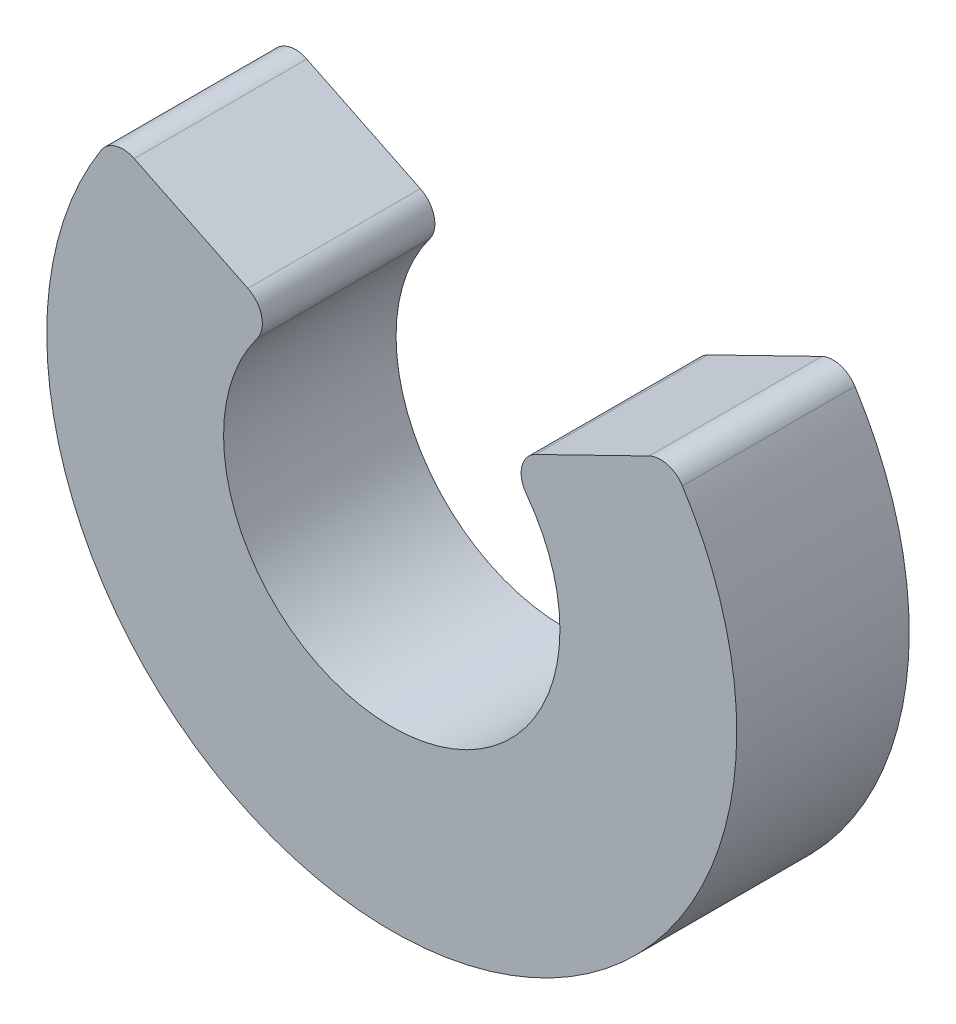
ISO-10303-21;
HEADER;
FILE_DESCRIPTION(('STEP AP214'),'2;1');
FILE_NAME('part.step','',(''),(''),'','','');
FILE_SCHEMA(('AUTOMOTIVE_DESIGN { 1 0 10303 214 1 1 1 1 }'));
ENDSEC;
DATA;
#1=APPLICATION_CONTEXT('core data for automotive mechanical design processes');
#2=APPLICATION_PROTOCOL_DEFINITION('international standard','automotive_design',2000,#1);
#3=PRODUCT_CONTEXT('',#1,'mechanical');
#4=PRODUCT('Part','Part','',(#3));
#5=PRODUCT_RELATED_PRODUCT_CATEGORY('part','',(#4));
#6=PRODUCT_DEFINITION_FORMATION('','',#4);
#7=PRODUCT_DEFINITION_CONTEXT('part definition',#1,'design');
#8=PRODUCT_DEFINITION('design','',#6,#7);
#9=PRODUCT_DEFINITION_SHAPE('','',#8);
#10=(LENGTH_UNIT() NAMED_UNIT(*) SI_UNIT(.MILLI.,.METRE.));
#11=(NAMED_UNIT(*) PLANE_ANGLE_UNIT() SI_UNIT($,.RADIAN.));
#12=(NAMED_UNIT(*) SI_UNIT($,.STERADIAN.) SOLID_ANGLE_UNIT());
#13=UNCERTAINTY_MEASURE_WITH_UNIT(LENGTH_MEASURE(1.E-05),#10,'distance_accuracy_value','');
#14=(GEOMETRIC_REPRESENTATION_CONTEXT(3) GLOBAL_UNCERTAINTY_ASSIGNED_CONTEXT((#13)) GLOBAL_UNIT_ASSIGNED_CONTEXT((#10,
#11,#12)) REPRESENTATION_CONTEXT('',''));
#15=CARTESIAN_POINT('',(0.,0.,0.));
#16=DIRECTION('',(0.,0.,1.));
#17=DIRECTION('',(1.,0.,0.));
#18=AXIS2_PLACEMENT_3D('',#15,#16,#17);
#19=CARTESIAN_POINT('',(3.11728566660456,1.99312068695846,2.));
#20=DIRECTION('',(0.,0.,-1.));
#21=DIRECTION('',(-1.,0.,0.));
#22=AXIS2_PLACEMENT_3D('',#19,#20,#21);
#23=CYLINDRICAL_SURFACE('',#22,0.3);
#24=CARTESIAN_POINT('',(3.11728566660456,1.99312068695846,0.));
#25=DIRECTION('',(0.,0.,1.));
#26=DIRECTION('',(-1.,0.,0.));
#27=AXIS2_PLACEMENT_3D('',#24,#25,#26);
#28=CIRCLE('',#27,0.3);
#29=CARTESIAN_POINT('',(3.37003855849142,2.15472506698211,0.));
#30=VERTEX_POINT('',#29);
#31=CARTESIAN_POINT('',(2.98566893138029,2.26270747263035,0.));
#32=VERTEX_POINT('',#31);
#33=EDGE_CURVE('E129',#30,#32,#28,.T.);
#34=ORIENTED_EDGE('',*,*,#33,.T.);
#35=DIRECTION('',(0.,0.,-1.));
#36=VECTOR('',#35,1.);
#37=CARTESIAN_POINT('',(2.98566893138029,2.26270747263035,2.));
#38=LINE('',#37,#36);
#39=CARTESIAN_POINT('',(2.98566893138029,2.26270747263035,2.));
#40=VERTEX_POINT('',#39);
#41=EDGE_CURVE('E11',#40,#32,#38,.T.);
#42=ORIENTED_EDGE('',*,*,#41,.F.);
#43=CARTESIAN_POINT('',(3.11728566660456,1.99312068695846,2.));
#44=DIRECTION('',(0.,0.,1.));
#45=DIRECTION('',(-1.,0.,0.));
#46=AXIS2_PLACEMENT_3D('',#43,#44,#45);
#47=CIRCLE('',#46,0.3);
#48=CARTESIAN_POINT('',(3.37003855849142,2.15472506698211,2.));
#49=VERTEX_POINT('',#48);
#50=EDGE_CURVE('E143',#49,#40,#47,.T.);
#51=ORIENTED_EDGE('',*,*,#50,.F.);
#52=DIRECTION('',(0.,0.,-1.));
#53=VECTOR('',#52,1.);
#54=CARTESIAN_POINT('',(3.37003855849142,2.15472506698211,2.));
#55=LINE('',#54,#53);
#56=EDGE_CURVE('E125',#49,#30,#55,.T.);
#57=ORIENTED_EDGE('',*,*,#56,.T.);
#58=EDGE_LOOP('',(#34,#42,#51,#57));
#59=FACE_BOUND('',#58,.T.);
#60=ADVANCED_FACE('F33',(#59),#23,.T.);
#61=CARTESIAN_POINT('',(2.98566893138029,2.26270747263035,2.));
#62=DIRECTION('',(0.438722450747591,-0.898622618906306,0.));
#63=DIRECTION('',(0.898622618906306,0.438722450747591,0.));
#64=AXIS2_PLACEMENT_3D('',#61,#62,#63);
#65=PLANE('',#64);
#66=DIRECTION('',(-0.898622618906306,-0.438722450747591,0.));
#67=VECTOR('',#66,1.);
#68=CARTESIAN_POINT('',(2.98566893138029,2.26270747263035,0.));
#69=LINE('',#68,#67);
#70=CARTESIAN_POINT('',(1.66838326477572,1.61958678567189,0.));
#71=VERTEX_POINT('',#70);
#72=EDGE_CURVE('E132',#32,#71,#69,.T.);
#73=ORIENTED_EDGE('',*,*,#72,.T.);
#74=DIRECTION('',(0.,0.,-1.));
#75=VECTOR('',#74,1.);
#76=CARTESIAN_POINT('',(1.66838326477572,1.61958678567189,2.));
#77=LINE('',#76,#75);
#78=CARTESIAN_POINT('',(1.66838326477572,1.61958678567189,2.));
#79=VERTEX_POINT('',#78);
#80=EDGE_CURVE('E41',#79,#71,#77,.T.);
#81=ORIENTED_EDGE('',*,*,#80,.F.);
#82=DIRECTION('',(-0.898622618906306,-0.438722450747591,0.));
#83=VECTOR('',#82,1.);
#84=CARTESIAN_POINT('',(2.98566893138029,2.26270747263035,2.));
#85=LINE('',#84,#83);
#86=EDGE_CURVE('E92',#40,#79,#85,.T.);
#87=ORIENTED_EDGE('',*,*,#86,.F.);
#88=ORIENTED_EDGE('',*,*,#41,.T.);
#89=EDGE_LOOP('',(#73,#81,#87,#88));
#90=FACE_BOUND('',#89,.T.);
#91=ADVANCED_FACE('F178',(#90),#65,.F.);
#92=CARTESIAN_POINT('',(1.8,1.35,2.));
#93=DIRECTION('',(0.,0.,-1.));
#94=DIRECTION('',(-1.,0.,0.));
#95=AXIS2_PLACEMENT_3D('',#92,#93,#94);
#96=CYLINDRICAL_SURFACE('',#95,0.3);
#97=CARTESIAN_POINT('',(1.8,1.35,0.));
#98=DIRECTION('',(0.,0.,1.));
#99=DIRECTION('',(1.,0.,0.));
#100=AXIS2_PLACEMENT_3D('',#97,#98,#99);
#101=CIRCLE('',#100,0.3);
#102=CARTESIAN_POINT('',(1.56,1.17,0.));
#103=VERTEX_POINT('',#102);
#104=EDGE_CURVE('E134',#71,#103,#101,.T.);
#105=ORIENTED_EDGE('',*,*,#104,.T.);
#106=DIRECTION('',(0.,0.,-1.));
#107=VECTOR('',#106,1.);
#108=CARTESIAN_POINT('',(1.56,1.17,2.));
#109=LINE('',#108,#107);
#110=CARTESIAN_POINT('',(1.56,1.17,2.));
#111=VERTEX_POINT('',#110);
#112=EDGE_CURVE('E150',#111,#103,#109,.T.);
#113=ORIENTED_EDGE('',*,*,#112,.F.);
#114=CARTESIAN_POINT('',(1.8,1.35,2.));
#115=DIRECTION('',(0.,0.,1.));
#116=DIRECTION('',(1.,0.,0.));
#117=AXIS2_PLACEMENT_3D('',#114,#115,#116);
#118=CIRCLE('',#117,0.3);
#119=EDGE_CURVE('E158',#79,#111,#118,.T.);
#120=ORIENTED_EDGE('',*,*,#119,.F.);
#121=ORIENTED_EDGE('',*,*,#80,.T.);
#122=EDGE_LOOP('',(#105,#113,#120,#121));
#123=FACE_BOUND('',#122,.T.);
#124=ADVANCED_FACE('F156',(#123),#96,.T.);
#125=CARTESIAN_POINT('',(0.,0.,2.));
#126=DIRECTION('',(0.,0.,-1.));
#127=DIRECTION('',(-1.,0.,0.));
#128=AXIS2_PLACEMENT_3D('',#125,#126,#127);
#129=CYLINDRICAL_SURFACE('',#128,1.95);
#130=CARTESIAN_POINT('',(0.,0.,0.));
#131=DIRECTION('',(0.,0.,-1.));
#132=DIRECTION('',(1.,0.,0.));
#133=AXIS2_PLACEMENT_3D('',#130,#131,#132);
#134=CIRCLE('',#133,1.95);
#135=CARTESIAN_POINT('',(-1.56,1.17,0.));
#136=VERTEX_POINT('',#135);
#137=EDGE_CURVE('E136',#103,#136,#134,.T.);
#138=ORIENTED_EDGE('',*,*,#137,.T.);
#139=DIRECTION('',(0.,0.,-1.));
#140=VECTOR('',#139,1.);
#141=CARTESIAN_POINT('',(-1.56,1.17,2.));
#142=LINE('',#141,#140);
#143=CARTESIAN_POINT('',(-1.56,1.17,2.));
#144=VERTEX_POINT('',#143);
#145=EDGE_CURVE('E147',#144,#136,#142,.T.);
#146=ORIENTED_EDGE('',*,*,#145,.F.);
#147=CARTESIAN_POINT('',(0.,0.,2.));
#148=DIRECTION('',(0.,0.,-1.));
#149=DIRECTION('',(1.,0.,0.));
#150=AXIS2_PLACEMENT_3D('',#147,#148,#149);
#151=CIRCLE('',#150,1.95);
#152=EDGE_CURVE('E170',#111,#144,#151,.T.);
#153=ORIENTED_EDGE('',*,*,#152,.F.);
#154=ORIENTED_EDGE('',*,*,#112,.T.);
#155=EDGE_LOOP('',(#138,#146,#153,#154));
#156=FACE_BOUND('',#155,.T.);
#157=ADVANCED_FACE('F166',(#156),#129,.F.);
#158=CARTESIAN_POINT('',(-1.8,1.35,2.));
#159=DIRECTION('',(0.,0.,-1.));
#160=DIRECTION('',(-1.,0.,0.));
#161=AXIS2_PLACEMENT_3D('',#158,#159,#160);
#162=CYLINDRICAL_SURFACE('',#161,0.3);
#163=CARTESIAN_POINT('',(-1.8,1.35,0.));
#164=DIRECTION('',(0.,0.,1.));
#165=DIRECTION('',(-1.,0.,0.));
#166=AXIS2_PLACEMENT_3D('',#163,#164,#165);
#167=CIRCLE('',#166,0.3);
#168=CARTESIAN_POINT('',(-1.66838326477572,1.61958678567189,0.));
#169=VERTEX_POINT('',#168);
#170=EDGE_CURVE('E138',#136,#169,#167,.T.);
#171=ORIENTED_EDGE('',*,*,#170,.T.);
#172=DIRECTION('',(0.,0.,-1.));
#173=VECTOR('',#172,1.);
#174=CARTESIAN_POINT('',(-1.66838326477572,1.61958678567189,2.));
#175=LINE('',#174,#173);
#176=CARTESIAN_POINT('',(-1.66838326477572,1.61958678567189,2.));
#177=VERTEX_POINT('',#176);
#178=EDGE_CURVE('E120',#177,#169,#175,.T.);
#179=ORIENTED_EDGE('',*,*,#178,.F.);
#180=CARTESIAN_POINT('',(-1.8,1.35,2.));
#181=DIRECTION('',(0.,0.,1.));
#182=DIRECTION('',(-1.,0.,0.));
#183=AXIS2_PLACEMENT_3D('',#180,#181,#182);
#184=CIRCLE('',#183,0.3);
#185=EDGE_CURVE('E111',#144,#177,#184,.T.);
#186=ORIENTED_EDGE('',*,*,#185,.F.);
#187=ORIENTED_EDGE('',*,*,#145,.T.);
#188=EDGE_LOOP('',(#171,#179,#186,#187));
#189=FACE_BOUND('',#188,.T.);
#190=ADVANCED_FACE('F169',(#189),#162,.T.);
#191=CARTESIAN_POINT('',(-2.98566893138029,2.26270747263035,2.));
#192=DIRECTION('',(-0.438722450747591,-0.898622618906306,0.));
#193=DIRECTION('',(0.898622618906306,-0.438722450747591,0.));
#194=AXIS2_PLACEMENT_3D('',#191,#192,#193);
#195=PLANE('',#194);
#196=DIRECTION('',(-0.898622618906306,0.438722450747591,0.));
#197=VECTOR('',#196,1.);
#198=CARTESIAN_POINT('',(-2.98566893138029,2.26270747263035,0.));
#199=LINE('',#198,#197);
#200=CARTESIAN_POINT('',(-2.98566893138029,2.26270747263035,0.));
#201=VERTEX_POINT('',#200);
#202=EDGE_CURVE('E119',#169,#201,#199,.T.);
#203=ORIENTED_EDGE('',*,*,#202,.T.);
#204=DIRECTION('',(0.,0.,-1.));
#205=VECTOR('',#204,1.);
#206=CARTESIAN_POINT('',(-2.98566893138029,2.26270747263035,2.));
#207=LINE('',#206,#205);
#208=CARTESIAN_POINT('',(-2.98566893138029,2.26270747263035,2.));
#209=VERTEX_POINT('',#208);
#210=EDGE_CURVE('E116',#209,#201,#207,.T.);
#211=ORIENTED_EDGE('',*,*,#210,.F.);
#212=DIRECTION('',(-0.898622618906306,0.438722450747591,0.));
#213=VECTOR('',#212,1.);
#214=CARTESIAN_POINT('',(-2.98566893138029,2.26270747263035,2.));
#215=LINE('',#214,#213);
#216=EDGE_CURVE('E105',#177,#209,#215,.T.);
#217=ORIENTED_EDGE('',*,*,#216,.F.);
#218=ORIENTED_EDGE('',*,*,#178,.T.);
#219=EDGE_LOOP('',(#203,#211,#217,#218));
#220=FACE_BOUND('',#219,.T.);
#221=ADVANCED_FACE('F117',(#220),#195,.F.);
#222=CARTESIAN_POINT('',(-3.11728566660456,1.99312068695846,2.));
#223=DIRECTION('',(0.,0.,-1.));
#224=DIRECTION('',(-1.,0.,0.));
#225=AXIS2_PLACEMENT_3D('',#222,#223,#224);
#226=CYLINDRICAL_SURFACE('',#225,0.3);
#227=CARTESIAN_POINT('',(-3.11728566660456,1.99312068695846,0.));
#228=DIRECTION('',(0.,0.,1.));
#229=DIRECTION('',(1.,0.,0.));
#230=AXIS2_PLACEMENT_3D('',#227,#228,#229);
#231=CIRCLE('',#230,0.3);
#232=CARTESIAN_POINT('',(-3.37003855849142,2.15472506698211,0.));
#233=VERTEX_POINT('',#232);
#234=EDGE_CURVE('E78',#201,#233,#231,.T.);
#235=ORIENTED_EDGE('',*,*,#234,.T.);
#236=DIRECTION('',(0.,0.,-1.));
#237=VECTOR('',#236,1.);
#238=CARTESIAN_POINT('',(-3.37003855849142,2.15472506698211,2.));
#239=LINE('',#238,#237);
#240=CARTESIAN_POINT('',(-3.37003855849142,2.15472506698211,2.));
#241=VERTEX_POINT('',#240);
#242=EDGE_CURVE('E121',#241,#233,#239,.T.);
#243=ORIENTED_EDGE('',*,*,#242,.F.);
#244=CARTESIAN_POINT('',(-3.11728566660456,1.99312068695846,2.));
#245=DIRECTION('',(0.,0.,1.));
#246=DIRECTION('',(1.,0.,0.));
#247=AXIS2_PLACEMENT_3D('',#244,#245,#246);
#248=CIRCLE('',#247,0.3);
#249=EDGE_CURVE('E109',#209,#241,#248,.T.);
#250=ORIENTED_EDGE('',*,*,#249,.F.);
#251=ORIENTED_EDGE('',*,*,#210,.T.);
#252=EDGE_LOOP('',(#235,#243,#250,#251));
#253=FACE_BOUND('',#252,.T.);
#254=ADVANCED_FACE('F123',(#253),#226,.T.);
#255=CARTESIAN_POINT('',(0.,0.,2.));
#256=DIRECTION('',(0.,0.,-1.));
#257=DIRECTION('',(-1.,0.,0.));
#258=AXIS2_PLACEMENT_3D('',#255,#256,#257);
#259=CYLINDRICAL_SURFACE('',#258,4.);
#260=CARTESIAN_POINT('',(0.,0.,0.));
#261=DIRECTION('',(0.,0.,1.));
#262=DIRECTION('',(1.,0.,0.));
#263=AXIS2_PLACEMENT_3D('',#260,#261,#262);
#264=CIRCLE('',#263,4.);
#265=EDGE_CURVE('E84',#233,#30,#264,.T.);
#266=ORIENTED_EDGE('',*,*,#265,.T.);
#267=ORIENTED_EDGE('',*,*,#56,.F.);
#268=CARTESIAN_POINT('',(0.,0.,2.));
#269=DIRECTION('',(0.,0.,1.));
#270=DIRECTION('',(1.,0.,0.));
#271=AXIS2_PLACEMENT_3D('',#268,#269,#270);
#272=CIRCLE('',#271,4.);
#273=EDGE_CURVE('E49',#241,#49,#272,.T.);
#274=ORIENTED_EDGE('',*,*,#273,.F.);
#275=ORIENTED_EDGE('',*,*,#242,.T.);
#276=EDGE_LOOP('',(#266,#267,#274,#275));
#277=FACE_BOUND('',#276,.T.);
#278=ADVANCED_FACE('F194',(#277),#259,.T.);
#279=CARTESIAN_POINT('',(3.11728566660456,1.99312068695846,2.));
#280=DIRECTION('',(0.,0.,-1.));
#281=DIRECTION('',(-1.,0.,0.));
#282=AXIS2_PLACEMENT_3D('',#279,#280,#281);
#283=PLANE('',#282);
#284=ORIENTED_EDGE('',*,*,#50,.T.);
#285=ORIENTED_EDGE('',*,*,#86,.T.);
#286=ORIENTED_EDGE('',*,*,#119,.T.);
#287=ORIENTED_EDGE('',*,*,#152,.T.);
#288=ORIENTED_EDGE('',*,*,#185,.T.);
#289=ORIENTED_EDGE('',*,*,#216,.T.);
#290=ORIENTED_EDGE('',*,*,#249,.T.);
#291=ORIENTED_EDGE('',*,*,#273,.T.);
#292=EDGE_LOOP('',(#284,#285,#286,#287,#288,#289,#290,#291));
#293=FACE_BOUND('',#292,.T.);
#294=ADVANCED_FACE('F107',(#293),#283,.F.);
#295=CARTESIAN_POINT('',(3.11728566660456,1.99312068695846,0.));
#296=DIRECTION('',(0.,0.,-1.));
#297=DIRECTION('',(-1.,0.,0.));
#298=AXIS2_PLACEMENT_3D('',#295,#296,#297);
#299=PLANE('',#298);
#300=ORIENTED_EDGE('',*,*,#33,.F.);
#301=ORIENTED_EDGE('',*,*,#265,.F.);
#302=ORIENTED_EDGE('',*,*,#234,.F.);
#303=ORIENTED_EDGE('',*,*,#202,.F.);
#304=ORIENTED_EDGE('',*,*,#170,.F.);
#305=ORIENTED_EDGE('',*,*,#137,.F.);
#306=ORIENTED_EDGE('',*,*,#104,.F.);
#307=ORIENTED_EDGE('',*,*,#72,.F.);
#308=EDGE_LOOP('',(#300,#301,#302,#303,#304,#305,#306,#307));
#309=FACE_BOUND('',#308,.T.);
#310=ADVANCED_FACE('F162',(#309),#299,.T.);
#311=CLOSED_SHELL('',(#60,#91,#124,#157,#190,#221,#254,#278,#294,#310));
#312=MANIFOLD_SOLID_BREP('B2',#311);
#313=ADVANCED_BREP_SHAPE_REPRESENTATION('',(#18,#312),#14);
#314=SHAPE_DEFINITION_REPRESENTATION(#9,#313);
ENDSEC;
END-ISO-10303-21;
